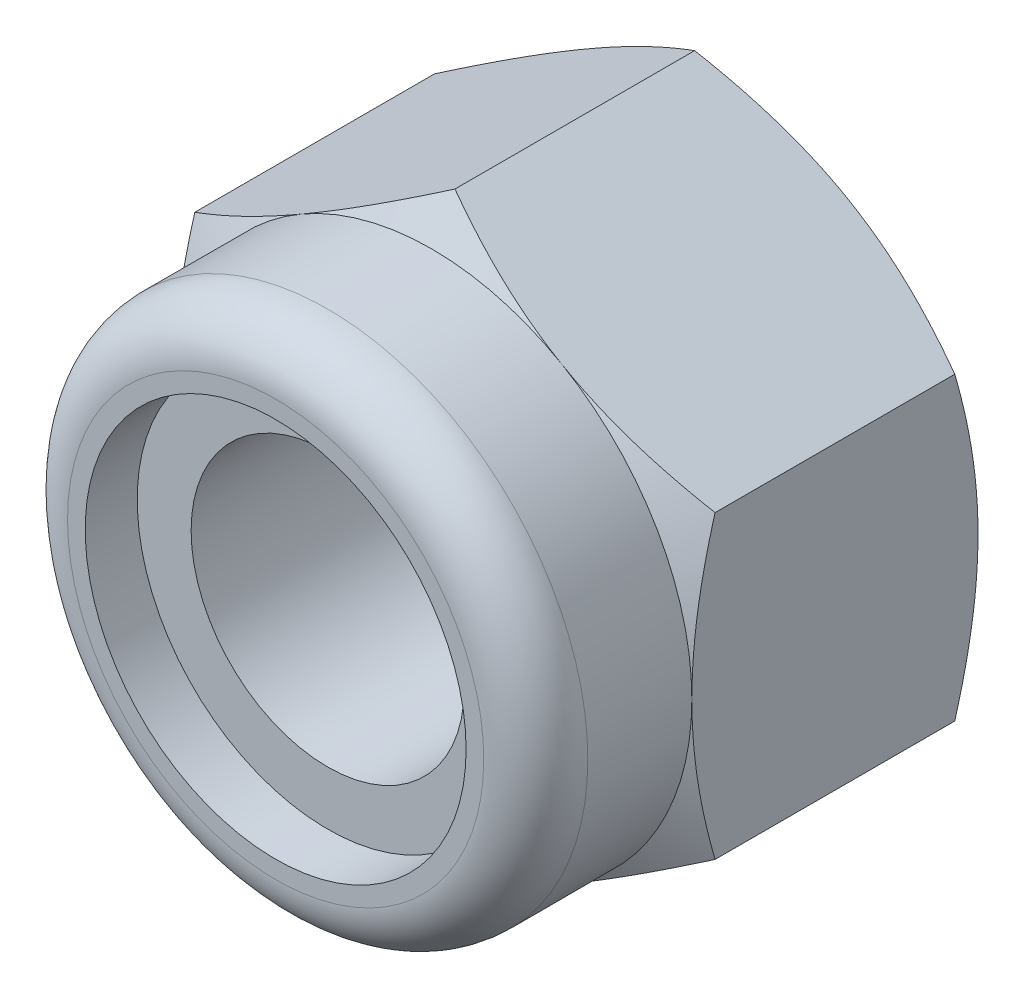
ISO-10303-21;
HEADER;
FILE_DESCRIPTION(('STEP AP214'),'2;1');
FILE_NAME('part.step','',(''),(''),'','','');
FILE_SCHEMA(('AUTOMOTIVE_DESIGN { 1 0 10303 214 1 1 1 1 }'));
ENDSEC;
DATA;
#1=APPLICATION_CONTEXT('core data for automotive mechanical design processes');
#2=APPLICATION_PROTOCOL_DEFINITION('international standard','automotive_design',2000,#1);
#3=PRODUCT_CONTEXT('',#1,'mechanical');
#4=PRODUCT('Part','Part','',(#3));
#5=PRODUCT_RELATED_PRODUCT_CATEGORY('part','',(#4));
#6=PRODUCT_DEFINITION_FORMATION('','',#4);
#7=PRODUCT_DEFINITION_CONTEXT('part definition',#1,'design');
#8=PRODUCT_DEFINITION('design','',#6,#7);
#9=PRODUCT_DEFINITION_SHAPE('','',#8);
#10=(LENGTH_UNIT() NAMED_UNIT(*) SI_UNIT(.MILLI.,.METRE.));
#11=(NAMED_UNIT(*) PLANE_ANGLE_UNIT() SI_UNIT($,.RADIAN.));
#12=(NAMED_UNIT(*) SI_UNIT($,.STERADIAN.) SOLID_ANGLE_UNIT());
#13=UNCERTAINTY_MEASURE_WITH_UNIT(LENGTH_MEASURE(1.E-05),#10,'distance_accuracy_value','');
#14=(GEOMETRIC_REPRESENTATION_CONTEXT(3) GLOBAL_UNCERTAINTY_ASSIGNED_CONTEXT((#13)) GLOBAL_UNIT_ASSIGNED_CONTEXT((#10,
#11,#12)) REPRESENTATION_CONTEXT('',''));
#15=CARTESIAN_POINT('',(0.,0.,0.));
#16=DIRECTION('',(0.,0.,1.));
#17=DIRECTION('',(1.,0.,0.));
#18=AXIS2_PLACEMENT_3D('',#15,#16,#17);
#19=CARTESIAN_POINT('',(0.,0.,-4.4));
#20=DIRECTION('',(0.,0.,1.));
#21=DIRECTION('',(1.,0.,0.));
#22=AXIS2_PLACEMENT_3D('',#19,#20,#21);
#23=CYLINDRICAL_SURFACE('',#22,2.1);
#24=CARTESIAN_POINT('',(0.,0.,1.6));
#25=DIRECTION('',(0.,0.,1.));
#26=DIRECTION('',(1.,0.,0.));
#27=AXIS2_PLACEMENT_3D('',#24,#25,#26);
#28=CIRCLE('',#27,2.1);
#29=CARTESIAN_POINT('',(2.1,0.,1.6));
#30=VERTEX_POINT('',#29);
#31=EDGE_CURVE('E272',#30,#30,#28,.T.);
#32=ORIENTED_EDGE('',*,*,#31,.T.);
#33=EDGE_LOOP('',(#32));
#34=FACE_BOUND('',#33,.T.);
#35=CARTESIAN_POINT('',(0.,0.,-4.09451698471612));
#36=DIRECTION('',(0.,0.,-1.));
#37=DIRECTION('',(-1.,0.,0.));
#38=AXIS2_PLACEMENT_3D('',#35,#36,#37);
#39=CIRCLE('',#38,2.1);
#40=CARTESIAN_POINT('',(-2.1,0.,-4.09451698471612));
#41=VERTEX_POINT('',#40);
#42=EDGE_CURVE('E39',#41,#41,#39,.F.);
#43=ORIENTED_EDGE('',*,*,#42,.F.);
#44=EDGE_LOOP('',(#43));
#45=FACE_BOUND('',#44,.T.);
#46=ADVANCED_FACE('F34',(#34,#45),#23,.F.);
#47=CARTESIAN_POINT('',(0.,4.61880215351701,-4.4));
#48=DIRECTION('',(-0.500000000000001,0.866025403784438,0.));
#49=DIRECTION('',(-0.866025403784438,-0.500000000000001,0.));
#50=AXIS2_PLACEMENT_3D('',#47,#48,#49);
#51=PLANE('',#50);
#52=DIRECTION('',(0.,0.,1.));
#53=VECTOR('',#52,1.);
#54=CARTESIAN_POINT('',(-4.,2.3094010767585,-4.4));
#55=LINE('',#54,#53);
#56=CARTESIAN_POINT('',(-4.,2.30940107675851,-4.04273441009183));
#57=VERTEX_POINT('',#56);
#58=CARTESIAN_POINT('',(-4.,2.3094010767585,-0.357265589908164));
#59=VERTEX_POINT('',#58);
#60=EDGE_CURVE('E245',#57,#59,#55,.T.);
#61=ORIENTED_EDGE('',*,*,#60,.T.);
#62=CARTESIAN_POINT('',(-4.0002,2.30928560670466,-0.357332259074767));
#63=CARTESIAN_POINT('',(-3.82442084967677,2.4107717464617,-0.298717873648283));
#64=CARTESIAN_POINT('',(-3.64712438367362,2.51313390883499,-0.245410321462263));
#65=CARTESIAN_POINT('',(-3.28946140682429,2.71963072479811,-0.152361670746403));
#66=CARTESIAN_POINT('',(-3.10908854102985,2.82376904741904,-0.112653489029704));
#67=CARTESIAN_POINT('',(-2.75057818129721,3.03075510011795,-0.0508422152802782));
#68=CARTESIAN_POINT('',(-2.57249584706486,3.13357098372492,-0.0283277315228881));
#69=CARTESIAN_POINT('',(-2.21549328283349,3.33968651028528,-0.001450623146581));
#70=CARTESIAN_POINT('',(-2.0365743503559,3.44298540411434,0.00293425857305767));
#71=CARTESIAN_POINT('',(-1.70225715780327,3.63600352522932,-0.00619007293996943));
#72=CARTESIAN_POINT('',(-1.54680884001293,3.72575165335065,-0.0174589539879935));
#73=CARTESIAN_POINT('',(-1.23692494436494,3.90466320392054,-0.0531739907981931));
#74=CARTESIAN_POINT('',(-1.08249043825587,3.99382600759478,-0.0776323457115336));
#75=CARTESIAN_POINT('',(-0.771967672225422,4.17310641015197,-0.138776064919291));
#76=CARTESIAN_POINT('',(-0.615918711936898,4.26320131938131,-0.175720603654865));
#77=CARTESIAN_POINT('',(-0.306148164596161,4.44204742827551,-0.259570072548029));
#78=CARTESIAN_POINT('',(-0.152422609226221,4.53080091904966,-0.306455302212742));
#79=CARTESIAN_POINT('',(0.000199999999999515,4.61891762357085,-0.35733225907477));
#80=B_SPLINE_CURVE_WITH_KNOTS('',3,(#62,#63,#64,#65,#66,#67,#68,#69,#70,#71,#72,#73,#74,#75,#76,
#77,#78,#79),.UNSPECIFIED.,.F.,.F.,(4,2,2,2,2,2,2,2,4),(0.,0.634047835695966,1.26961969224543,
1.88946157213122,2.50854226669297,3.04757825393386,3.58711366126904,4.13861653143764,
4.68903648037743),.UNSPECIFIED.);
#81=CARTESIAN_POINT('',(-2.,3.46410161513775,0.));
#82=VERTEX_POINT('',#81);
#83=EDGE_CURVE('E59',#59,#82,#80,.T.);
#84=ORIENTED_EDGE('',*,*,#83,.T.);
#85=CARTESIAN_POINT('',(0.,4.61880215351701,-0.357265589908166));
#86=VERTEX_POINT('',#85);
#87=EDGE_CURVE('E197',#82,#86,#80,.T.);
#88=ORIENTED_EDGE('',*,*,#87,.T.);
#89=DIRECTION('',(0.,0.,1.));
#90=VECTOR('',#89,1.);
#91=CARTESIAN_POINT('',(0.,4.61880215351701,-4.4));
#92=LINE('',#91,#90);
#93=CARTESIAN_POINT('',(0.,4.61880215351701,-4.04273441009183));
#94=VERTEX_POINT('',#93);
#95=EDGE_CURVE('E231',#94,#86,#92,.T.);
#96=ORIENTED_EDGE('',*,*,#95,.F.);
#97=CARTESIAN_POINT('',(-4.0002,2.30928560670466,-4.04266774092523));
#98=CARTESIAN_POINT('',(-3.82442084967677,2.4107717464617,-4.10128212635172));
#99=CARTESIAN_POINT('',(-3.64712438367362,2.51313390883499,-4.15458967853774));
#100=CARTESIAN_POINT('',(-3.28946140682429,2.71963072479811,-4.2476383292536));
#101=CARTESIAN_POINT('',(-3.10908854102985,2.82376904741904,-4.2873465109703));
#102=CARTESIAN_POINT('',(-2.75057818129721,3.03075510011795,-4.34915778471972));
#103=CARTESIAN_POINT('',(-2.57249584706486,3.13357098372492,-4.37167226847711));
#104=CARTESIAN_POINT('',(-2.21549328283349,3.33968651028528,-4.39854937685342));
#105=CARTESIAN_POINT('',(-2.0365743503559,3.44298540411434,-4.40293425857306));
#106=CARTESIAN_POINT('',(-1.70225715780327,3.63600352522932,-4.39380992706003));
#107=CARTESIAN_POINT('',(-1.54680884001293,3.72575165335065,-4.38254104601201));
#108=CARTESIAN_POINT('',(-1.23692494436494,3.90466320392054,-4.34682600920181));
#109=CARTESIAN_POINT('',(-1.08249043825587,3.99382600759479,-4.32236765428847));
#110=CARTESIAN_POINT('',(-0.771967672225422,4.17310641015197,-4.26122393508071));
#111=CARTESIAN_POINT('',(-0.615918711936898,4.26320131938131,-4.22427939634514));
#112=CARTESIAN_POINT('',(-0.306148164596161,4.44204742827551,-4.14042992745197));
#113=CARTESIAN_POINT('',(-0.152422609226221,4.53080091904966,-4.09354469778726));
#114=CARTESIAN_POINT('',(0.00019999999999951,4.61891762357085,-4.04266774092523));
#115=B_SPLINE_CURVE_WITH_KNOTS('',3,(#97,#98,#99,#100,#101,#102,#103,#104,#105,#106,#107,#108,
#109,#110,#111,#112,#113,#114),.UNSPECIFIED.,.F.,.F.,(4,2,2,2,2,2,2,2,4),(0.,0.634047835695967,
1.26961969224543,1.88946157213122,2.50854226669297,3.04757825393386,3.58711366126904,
4.13861653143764,4.68903648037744),.UNSPECIFIED.);
#116=CARTESIAN_POINT('',(-2.,3.46410161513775,-4.4));
#117=VERTEX_POINT('',#116);
#118=EDGE_CURVE('E247',#117,#94,#115,.T.);
#119=ORIENTED_EDGE('',*,*,#118,.F.);
#120=EDGE_CURVE('E226',#57,#117,#115,.T.);
#121=ORIENTED_EDGE('',*,*,#120,.F.);
#122=EDGE_LOOP('',(#61,#84,#88,#96,#119,#121));
#123=FACE_BOUND('',#122,.T.);
#124=ADVANCED_FACE('F36',(#123),#51,.T.);
#125=CARTESIAN_POINT('',(4.,2.3094010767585,-4.4));
#126=DIRECTION('',(0.500000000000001,0.866025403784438,0.));
#127=DIRECTION('',(-0.866025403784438,0.500000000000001,0.));
#128=AXIS2_PLACEMENT_3D('',#125,#126,#127);
#129=PLANE('',#128);
#130=ORIENTED_EDGE('',*,*,#95,.T.);
#131=CARTESIAN_POINT('',(-0.000200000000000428,4.61891762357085,-0.35733225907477));
#132=CARTESIAN_POINT('',(0.175579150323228,4.51743148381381,-0.298717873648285));
#133=CARTESIAN_POINT('',(0.352875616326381,4.41506932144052,-0.245410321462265));
#134=CARTESIAN_POINT('',(0.710538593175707,4.2085725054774,-0.152361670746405));
#135=CARTESIAN_POINT('',(0.890911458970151,4.10443418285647,-0.112653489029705));
#136=CARTESIAN_POINT('',(1.24942181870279,3.89744813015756,-0.0508422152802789));
#137=CARTESIAN_POINT('',(1.42750415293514,3.79463224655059,-0.0283277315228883));
#138=CARTESIAN_POINT('',(1.78450671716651,3.58851671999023,-0.001450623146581));
#139=CARTESIAN_POINT('',(1.9634256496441,3.48521782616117,0.00293425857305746));
#140=CARTESIAN_POINT('',(2.29774284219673,3.29219970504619,-0.00619007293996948));
#141=CARTESIAN_POINT('',(2.45319115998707,3.20245157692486,-0.0174589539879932));
#142=CARTESIAN_POINT('',(2.76307505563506,3.02354002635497,-0.053173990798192));
#143=CARTESIAN_POINT('',(2.91750956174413,2.93437722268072,-0.077632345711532));
#144=CARTESIAN_POINT('',(3.22803232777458,2.75509682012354,-0.138776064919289));
#145=CARTESIAN_POINT('',(3.3840812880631,2.6650019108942,-0.175720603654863));
#146=CARTESIAN_POINT('',(3.69385183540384,2.486155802,-0.259570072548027));
#147=CARTESIAN_POINT('',(3.84757739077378,2.39740231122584,-0.306455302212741));
#148=CARTESIAN_POINT('',(4.0002,2.30928560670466,-0.357332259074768));
#149=B_SPLINE_CURVE_WITH_KNOTS('',3,(#131,#132,#133,#134,#135,#136,#137,#138,#139,#140,#141,
#142,#143,#144,#145,#146,#147,#148),.UNSPECIFIED.,.F.,.F.,(4,2,2,2,2,2,2,2,4),(0.,
0.634047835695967,1.26961969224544,1.88946157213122,2.50854226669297,3.04757825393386,
3.58711366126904,4.13861653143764,4.68903648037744),.UNSPECIFIED.);
#150=CARTESIAN_POINT('',(2.,3.46410161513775,0.));
#151=VERTEX_POINT('',#150);
#152=EDGE_CURVE('E205',#86,#151,#149,.T.);
#153=ORIENTED_EDGE('',*,*,#152,.T.);
#154=CARTESIAN_POINT('',(4.,2.30940107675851,-0.357265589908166));
#155=VERTEX_POINT('',#154);
#156=EDGE_CURVE('E198',#151,#155,#149,.T.);
#157=ORIENTED_EDGE('',*,*,#156,.T.);
#158=DIRECTION('',(0.,0.,1.));
#159=VECTOR('',#158,1.);
#160=CARTESIAN_POINT('',(4.,2.3094010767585,-4.4));
#161=LINE('',#160,#159);
#162=CARTESIAN_POINT('',(4.,2.30940107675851,-4.04273441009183));
#163=VERTEX_POINT('',#162);
#164=EDGE_CURVE('E235',#163,#155,#161,.T.);
#165=ORIENTED_EDGE('',*,*,#164,.F.);
#166=CARTESIAN_POINT('',(-0.000200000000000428,4.61891762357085,-4.04266774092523));
#167=CARTESIAN_POINT('',(0.175579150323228,4.51743148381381,-4.10128212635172));
#168=CARTESIAN_POINT('',(0.352875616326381,4.41506932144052,-4.15458967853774));
#169=CARTESIAN_POINT('',(0.710538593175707,4.2085725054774,-4.2476383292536));
#170=CARTESIAN_POINT('',(0.890911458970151,4.10443418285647,-4.2873465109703));
#171=CARTESIAN_POINT('',(1.24942181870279,3.89744813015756,-4.34915778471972));
#172=CARTESIAN_POINT('',(1.42750415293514,3.79463224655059,-4.37167226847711));
#173=CARTESIAN_POINT('',(1.78450671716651,3.58851671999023,-4.39854937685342));
#174=CARTESIAN_POINT('',(1.9634256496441,3.48521782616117,-4.40293425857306));
#175=CARTESIAN_POINT('',(2.29774284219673,3.29219970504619,-4.39380992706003));
#176=CARTESIAN_POINT('',(2.45319115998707,3.20245157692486,-4.38254104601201));
#177=CARTESIAN_POINT('',(2.76307505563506,3.02354002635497,-4.34682600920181));
#178=CARTESIAN_POINT('',(2.91750956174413,2.93437722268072,-4.32236765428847));
#179=CARTESIAN_POINT('',(3.22803232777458,2.75509682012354,-4.26122393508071));
#180=CARTESIAN_POINT('',(3.3840812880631,2.6650019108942,-4.22427939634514));
#181=CARTESIAN_POINT('',(3.69385183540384,2.486155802,-4.14042992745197));
#182=CARTESIAN_POINT('',(3.84757739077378,2.39740231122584,-4.09354469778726));
#183=CARTESIAN_POINT('',(4.0002,2.30928560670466,-4.04266774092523));
#184=B_SPLINE_CURVE_WITH_KNOTS('',3,(#166,#167,#168,#169,#170,#171,#172,#173,#174,#175,#176,
#177,#178,#179,#180,#181,#182,#183),.UNSPECIFIED.,.F.,.F.,(4,2,2,2,2,2,2,2,4),(0.,
0.634047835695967,1.26961969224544,1.88946157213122,2.50854226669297,3.04757825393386,
3.58711366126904,4.13861653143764,4.68903648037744),.UNSPECIFIED.);
#185=CARTESIAN_POINT('',(2.,3.46410161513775,-4.4));
#186=VERTEX_POINT('',#185);
#187=EDGE_CURVE('E218',#186,#163,#184,.T.);
#188=ORIENTED_EDGE('',*,*,#187,.F.);
#189=EDGE_CURVE('E224',#94,#186,#184,.T.);
#190=ORIENTED_EDGE('',*,*,#189,.F.);
#191=EDGE_LOOP('',(#130,#153,#157,#165,#188,#190));
#192=FACE_BOUND('',#191,.T.);
#193=ADVANCED_FACE('F208',(#192),#129,.T.);
#194=CARTESIAN_POINT('',(4.,2.3094010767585,-4.4));
#195=DIRECTION('',(-1.,0.,0.));
#196=DIRECTION('',(0.,0.,1.));
#197=AXIS2_PLACEMENT_3D('',#194,#195,#196);
#198=PLANE('',#197);
#199=CARTESIAN_POINT('',(4.,-6.12487198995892,-1.91410682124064));
#200=CARTESIAN_POINT('',(4.,-5.94924937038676,-1.8292362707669));
#201=CARTESIAN_POINT('',(4.,-5.77321152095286,-1.7452094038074));
#202=CARTESIAN_POINT('',(4.,-5.42008084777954,-1.57932514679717));
#203=CARTESIAN_POINT('',(4.,-5.24298784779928,-1.49746813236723));
#204=CARTESIAN_POINT('',(4.,-4.88656571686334,-1.33597446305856));
#205=CARTESIAN_POINT('',(4.,-4.70722958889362,-1.25635319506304));
#206=CARTESIAN_POINT('',(4.,-4.34708334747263,-1.1005305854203));
#207=CARTESIAN_POINT('',(4.,-4.16627331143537,-1.02432906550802));
#208=CARTESIAN_POINT('',(4.,-3.80064706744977,-0.875350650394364));
#209=CARTESIAN_POINT('',(4.,-3.6158089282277,-0.802627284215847));
#210=CARTESIAN_POINT('',(4.,-3.24395246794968,-0.66287623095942));
#211=CARTESIAN_POINT('',(4.,-3.05693390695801,-0.595849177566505));
#212=CARTESIAN_POINT('',(4.,-2.6808031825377,-0.469291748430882));
#213=CARTESIAN_POINT('',(4.,-2.49169643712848,-0.409745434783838));
#214=CARTESIAN_POINT('',(4.,-2.11079454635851,-0.300083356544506));
#215=CARTESIAN_POINT('',(4.,-1.91900027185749,-0.249964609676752));
#216=CARTESIAN_POINT('',(4.,-1.532592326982,-0.161590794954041));
#217=CARTESIAN_POINT('',(4.,-1.3379779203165,-0.12333888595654));
#218=CARTESIAN_POINT('',(4.,-0.946402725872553,-0.0612742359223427));
#219=CARTESIAN_POINT('',(4.,-0.749441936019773,-0.0374615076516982));
#220=CARTESIAN_POINT('',(4.,-0.355451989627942,-0.0063818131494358));
#221=CARTESIAN_POINT('',(4.,-0.158431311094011,0.000989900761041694));
#222=CARTESIAN_POINT('',(4.,0.235472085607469,-0.00120406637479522));
#223=CARTESIAN_POINT('',(4.,0.432354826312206,-0.0107653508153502));
#224=CARTESIAN_POINT('',(4.,0.768560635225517,-0.0408787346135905));
#225=CARTESIAN_POINT('',(4.,0.908254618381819,-0.0575092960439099));
#226=CARTESIAN_POINT('',(4.,1.18656349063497,-0.0982134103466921));
#227=CARTESIAN_POINT('',(4.,1.32517820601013,-0.122288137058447));
#228=CARTESIAN_POINT('',(4.,1.73929045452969,-0.204415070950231));
#229=CARTESIAN_POINT('',(4.,2.01284690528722,-0.272348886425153));
#230=CARTESIAN_POINT('',(4.,2.42218253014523,-0.389516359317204));
#231=CARTESIAN_POINT('',(4.,2.56009536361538,-0.431713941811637));
#232=CARTESIAN_POINT('',(4.,2.83448159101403,-0.520284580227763));
#233=CARTESIAN_POINT('',(4.,2.97095590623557,-0.566654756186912));
#234=CARTESIAN_POINT('',(4.,3.2418944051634,-0.662605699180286));
#235=CARTESIAN_POINT('',(4.,3.37636557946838,-0.7121669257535));
#236=CARTESIAN_POINT('',(4.,3.64426461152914,-0.814198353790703));
#237=CARTESIAN_POINT('',(4.,3.77769202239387,-0.86666973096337));
#238=CARTESIAN_POINT('',(4.,3.91063698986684,-0.920309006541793));
#239=B_SPLINE_CURVE_WITH_KNOTS('',3,(#199,#200,#201,#202,#203,#204,#205,#206,#207,#208,#209,
#210,#211,#212,#213,#214,#215,#216,#217,#218,#219,#220,#221,#222,#223,#224,#225,#226,#227,#228,
#229,#230,#231,#232,#233,#234,#235,#236,#237,#238),.UNSPECIFIED.,.F.,.F.,(4,2,2,2,2,2,2,2,2,2,2,
2,2,2,2,2,2,2,2,4),(0.,0.58517179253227,1.17044423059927,1.7590659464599,2.34765694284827,
2.94347400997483,3.53935727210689,4.13394864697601,4.72835161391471,5.32291267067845,
5.91747425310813,6.50823685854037,7.09884609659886,7.52068140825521,7.9425832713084,
8.78701491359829,9.21965281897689,9.65199437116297,10.0819024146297,10.5119854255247),.UNSPECIFIED.);
#240=CARTESIAN_POINT('',(4.,-2.30940107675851,-0.357265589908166));
#241=VERTEX_POINT('',#240);
#242=CARTESIAN_POINT('',(4.,0.,0.));
#243=VERTEX_POINT('',#242);
#244=EDGE_CURVE('E187',#241,#243,#239,.T.);
#245=ORIENTED_EDGE('',*,*,#244,.F.);
#246=DIRECTION('',(0.,0.,1.));
#247=VECTOR('',#246,1.);
#248=CARTESIAN_POINT('',(4.,-2.30940107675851,-4.4));
#249=LINE('',#248,#247);
#250=CARTESIAN_POINT('',(4.,-2.30940107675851,-4.04273441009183));
#251=VERTEX_POINT('',#250);
#252=EDGE_CURVE('E238',#251,#241,#249,.T.);
#253=ORIENTED_EDGE('',*,*,#252,.F.);
#254=CARTESIAN_POINT('',(4.,-6.12487198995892,-2.48589317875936));
#255=CARTESIAN_POINT('',(4.,-5.94924937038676,-2.5707637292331));
#256=CARTESIAN_POINT('',(4.,-5.77321152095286,-2.6547905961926));
#257=CARTESIAN_POINT('',(4.,-5.42008084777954,-2.82067485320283));
#258=CARTESIAN_POINT('',(4.,-5.24298784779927,-2.90253186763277));
#259=CARTESIAN_POINT('',(4.,-4.88656571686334,-3.06402553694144));
#260=CARTESIAN_POINT('',(4.,-4.70722958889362,-3.14364680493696));
#261=CARTESIAN_POINT('',(4.,-4.34708334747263,-3.2994694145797));
#262=CARTESIAN_POINT('',(4.,-4.16627331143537,-3.37567093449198));
#263=CARTESIAN_POINT('',(4.,-3.80064706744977,-3.52464934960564));
#264=CARTESIAN_POINT('',(4.,-3.6158089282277,-3.59737271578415));
#265=CARTESIAN_POINT('',(4.,-3.24395246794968,-3.73712376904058));
#266=CARTESIAN_POINT('',(4.,-3.05693390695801,-3.8041508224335));
#267=CARTESIAN_POINT('',(4.,-2.6808031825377,-3.93070825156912));
#268=CARTESIAN_POINT('',(4.,-2.49169643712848,-3.99025456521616));
#269=CARTESIAN_POINT('',(4.,-2.11079454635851,-4.09991664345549));
#270=CARTESIAN_POINT('',(4.,-1.91900027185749,-4.15003539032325));
#271=CARTESIAN_POINT('',(4.,-1.532592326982,-4.23840920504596));
#272=CARTESIAN_POINT('',(4.,-1.3379779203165,-4.27666111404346));
#273=CARTESIAN_POINT('',(4.,-0.946402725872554,-4.33872576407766));
#274=CARTESIAN_POINT('',(4.,-0.749441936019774,-4.3625384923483));
#275=CARTESIAN_POINT('',(4.,-0.355451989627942,-4.39361818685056));
#276=CARTESIAN_POINT('',(4.,-0.158431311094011,-4.40098990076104));
#277=CARTESIAN_POINT('',(4.,0.235472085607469,-4.39879593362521));
#278=CARTESIAN_POINT('',(4.,0.432354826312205,-4.38923464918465));
#279=CARTESIAN_POINT('',(4.,0.768560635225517,-4.35912126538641));
#280=CARTESIAN_POINT('',(4.,0.908254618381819,-4.34249070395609));
#281=CARTESIAN_POINT('',(4.,1.18656349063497,-4.30178658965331));
#282=CARTESIAN_POINT('',(4.,1.32517820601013,-4.27771186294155));
#283=CARTESIAN_POINT('',(4.,1.73929045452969,-4.19558492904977));
#284=CARTESIAN_POINT('',(4.,2.01284690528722,-4.12765111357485));
#285=CARTESIAN_POINT('',(4.,2.42218253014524,-4.0104836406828));
#286=CARTESIAN_POINT('',(4.,2.56009536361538,-3.96828605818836));
#287=CARTESIAN_POINT('',(4.,2.83448159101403,-3.87971541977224));
#288=CARTESIAN_POINT('',(4.,2.97095590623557,-3.83334524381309));
#289=CARTESIAN_POINT('',(4.,3.2418944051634,-3.73739430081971));
#290=CARTESIAN_POINT('',(4.,3.37636557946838,-3.6878330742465));
#291=CARTESIAN_POINT('',(4.,3.64426461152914,-3.5858016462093));
#292=CARTESIAN_POINT('',(4.,3.77769202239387,-3.53333026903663));
#293=CARTESIAN_POINT('',(4.,3.91063698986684,-3.47969099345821));
#294=B_SPLINE_CURVE_WITH_KNOTS('',3,(#254,#255,#256,#257,#258,#259,#260,#261,#262,#263,#264,
#265,#266,#267,#268,#269,#270,#271,#272,#273,#274,#275,#276,#277,#278,#279,#280,#281,#282,#283,
#284,#285,#286,#287,#288,#289,#290,#291,#292,#293),.UNSPECIFIED.,.F.,.F.,(4,2,2,2,2,2,2,2,2,2,2,
2,2,2,2,2,2,2,2,4),(0.,0.585171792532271,1.17044423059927,1.7590659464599,2.34765694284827,
2.94347400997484,3.53935727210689,4.13394864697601,4.72835161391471,5.32291267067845,
5.91747425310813,6.50823685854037,7.09884609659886,7.52068140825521,7.9425832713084,
8.78701491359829,9.21965281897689,9.65199437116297,10.0819024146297,10.5119854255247),.UNSPECIFIED.);
#295=CARTESIAN_POINT('',(4.,0.,-4.4));
#296=VERTEX_POINT('',#295);
#297=EDGE_CURVE('E360',#251,#296,#294,.T.);
#298=ORIENTED_EDGE('',*,*,#297,.T.);
#299=EDGE_CURVE('E225',#296,#163,#294,.T.);
#300=ORIENTED_EDGE('',*,*,#299,.T.);
#301=ORIENTED_EDGE('',*,*,#164,.T.);
#302=EDGE_CURVE('E196',#243,#155,#239,.T.);
#303=ORIENTED_EDGE('',*,*,#302,.F.);
#304=EDGE_LOOP('',(#245,#253,#298,#300,#301,#303));
#305=FACE_BOUND('',#304,.T.);
#306=ADVANCED_FACE('F212',(#305),#198,.F.);
#307=CARTESIAN_POINT('',(0.,-4.61880215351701,-4.4));
#308=DIRECTION('',(0.500000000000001,-0.866025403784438,0.));
#309=DIRECTION('',(0.866025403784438,0.500000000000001,0.));
#310=AXIS2_PLACEMENT_3D('',#307,#308,#309);
#311=PLANE('',#310);
#312=ORIENTED_EDGE('',*,*,#252,.T.);
#313=CARTESIAN_POINT('',(4.0002,-2.30928560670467,-0.35733225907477));
#314=CARTESIAN_POINT('',(3.82442084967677,-2.41077174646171,-0.298717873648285));
#315=CARTESIAN_POINT('',(3.64712438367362,-2.513133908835,-0.245410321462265));
#316=CARTESIAN_POINT('',(3.28946140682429,-2.71963072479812,-0.152361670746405));
#317=CARTESIAN_POINT('',(3.10908854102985,-2.82376904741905,-0.112653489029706));
#318=CARTESIAN_POINT('',(2.75057818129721,-3.03075510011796,-0.0508422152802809));
#319=CARTESIAN_POINT('',(2.57249584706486,-3.13357098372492,-0.0283277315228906));
#320=CARTESIAN_POINT('',(2.21549328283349,-3.33968651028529,-0.00145062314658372));
#321=CARTESIAN_POINT('',(2.0365743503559,-3.44298540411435,0.00293425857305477));
#322=CARTESIAN_POINT('',(1.70225715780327,-3.63600352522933,-0.00619007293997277));
#323=CARTESIAN_POINT('',(1.54680884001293,-3.72575165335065,-0.0174589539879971));
#324=CARTESIAN_POINT('',(1.23692494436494,-3.90466320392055,-0.0531739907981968));
#325=CARTESIAN_POINT('',(1.08249043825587,-3.99382600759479,-0.0776323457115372));
#326=CARTESIAN_POINT('',(0.771967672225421,-4.17310641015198,-0.138776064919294));
#327=CARTESIAN_POINT('',(0.615918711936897,-4.26320131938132,-0.175720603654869));
#328=CARTESIAN_POINT('',(0.30614816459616,-4.44204742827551,-0.259570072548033));
#329=CARTESIAN_POINT('',(0.152422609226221,-4.53080091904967,-0.306455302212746));
#330=CARTESIAN_POINT('',(-0.000199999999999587,-4.61891762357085,-0.357332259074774));
#331=B_SPLINE_CURVE_WITH_KNOTS('',3,(#313,#314,#315,#316,#317,#318,#319,#320,#321,#322,#323,
#324,#325,#326,#327,#328,#329,#330),.UNSPECIFIED.,.F.,.F.,(4,2,2,2,2,2,2,2,4),(0.,
0.634047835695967,1.26961969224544,1.88946157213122,2.50854226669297,3.04757825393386,
3.58711366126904,4.13861653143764,4.68903648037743),.UNSPECIFIED.);
#332=CARTESIAN_POINT('',(2.,-3.46410161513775,0.));
#333=VERTEX_POINT('',#332);
#334=EDGE_CURVE('E354',#241,#333,#331,.T.);
#335=ORIENTED_EDGE('',*,*,#334,.T.);
#336=CARTESIAN_POINT('',(0.,-4.61880215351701,-0.357265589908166));
#337=VERTEX_POINT('',#336);
#338=EDGE_CURVE('E181',#333,#337,#331,.T.);
#339=ORIENTED_EDGE('',*,*,#338,.T.);
#340=DIRECTION('',(0.,0.,1.));
#341=VECTOR('',#340,1.);
#342=CARTESIAN_POINT('',(0.,-4.61880215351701,-4.4));
#343=LINE('',#342,#341);
#344=CARTESIAN_POINT('',(0.,-4.61880215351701,-4.04273441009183));
#345=VERTEX_POINT('',#344);
#346=EDGE_CURVE('E241',#345,#337,#343,.T.);
#347=ORIENTED_EDGE('',*,*,#346,.F.);
#348=CARTESIAN_POINT('',(4.0002,-2.30928560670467,-4.04266774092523));
#349=CARTESIAN_POINT('',(3.82442084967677,-2.41077174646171,-4.10128212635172));
#350=CARTESIAN_POINT('',(3.64712438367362,-2.513133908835,-4.15458967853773));
#351=CARTESIAN_POINT('',(3.28946140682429,-2.71963072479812,-4.24763832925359));
#352=CARTESIAN_POINT('',(3.10908854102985,-2.82376904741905,-4.28734651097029));
#353=CARTESIAN_POINT('',(2.75057818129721,-3.03075510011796,-4.34915778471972));
#354=CARTESIAN_POINT('',(2.57249584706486,-3.13357098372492,-4.37167226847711));
#355=CARTESIAN_POINT('',(2.21549328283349,-3.33968651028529,-4.39854937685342));
#356=CARTESIAN_POINT('',(2.0365743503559,-3.44298540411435,-4.40293425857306));
#357=CARTESIAN_POINT('',(1.70225715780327,-3.63600352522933,-4.39380992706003));
#358=CARTESIAN_POINT('',(1.54680884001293,-3.72575165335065,-4.382541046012));
#359=CARTESIAN_POINT('',(1.23692494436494,-3.90466320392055,-4.3468260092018));
#360=CARTESIAN_POINT('',(1.08249043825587,-3.99382600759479,-4.32236765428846));
#361=CARTESIAN_POINT('',(0.771967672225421,-4.17310641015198,-4.26122393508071));
#362=CARTESIAN_POINT('',(0.615918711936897,-4.26320131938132,-4.22427939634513));
#363=CARTESIAN_POINT('',(0.30614816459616,-4.44204742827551,-4.14042992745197));
#364=CARTESIAN_POINT('',(0.152422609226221,-4.53080091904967,-4.09354469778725));
#365=CARTESIAN_POINT('',(-0.000199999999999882,-4.61891762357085,-4.04266774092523));
#366=B_SPLINE_CURVE_WITH_KNOTS('',3,(#348,#349,#350,#351,#352,#353,#354,#355,#356,#357,#358,
#359,#360,#361,#362,#363,#364,#365),.UNSPECIFIED.,.F.,.F.,(4,2,2,2,2,2,2,2,4),(0.,
0.634047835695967,1.26961969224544,1.88946157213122,2.50854226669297,3.04757825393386,
3.58711366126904,4.13861653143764,4.68903648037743),.UNSPECIFIED.);
#367=CARTESIAN_POINT('',(2.,-3.46410161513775,-4.4));
#368=VERTEX_POINT('',#367);
#369=EDGE_CURVE('E332',#368,#345,#366,.T.);
#370=ORIENTED_EDGE('',*,*,#369,.F.);
#371=EDGE_CURVE('E356',#251,#368,#366,.T.);
#372=ORIENTED_EDGE('',*,*,#371,.F.);
#373=EDGE_LOOP('',(#312,#335,#339,#347,#370,#372));
#374=FACE_BOUND('',#373,.T.);
#375=ADVANCED_FACE('F339',(#374),#311,.T.);
#376=CARTESIAN_POINT('',(-4.,-2.30940107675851,-4.4));
#377=DIRECTION('',(-0.500000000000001,-0.866025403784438,0.));
#378=DIRECTION('',(0.866025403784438,-0.500000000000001,0.));
#379=AXIS2_PLACEMENT_3D('',#376,#377,#378);
#380=PLANE('',#379);
#381=ORIENTED_EDGE('',*,*,#346,.T.);
#382=CARTESIAN_POINT('',(0.000200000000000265,-4.61891762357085,-0.357332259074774));
#383=CARTESIAN_POINT('',(-0.175579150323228,-4.51743148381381,-0.298717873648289));
#384=CARTESIAN_POINT('',(-0.352875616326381,-4.41506932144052,-0.245410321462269));
#385=CARTESIAN_POINT('',(-0.710538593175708,-4.2085725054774,-0.152361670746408));
#386=CARTESIAN_POINT('',(-0.890911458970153,-4.10443418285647,-0.112653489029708));
#387=CARTESIAN_POINT('',(-1.24942181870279,-3.89744813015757,-0.0508422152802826));
#388=CARTESIAN_POINT('',(-1.42750415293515,-3.7946322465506,-0.0283277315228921));
#389=CARTESIAN_POINT('',(-1.78450671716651,-3.58851671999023,-0.00145062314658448));
#390=CARTESIAN_POINT('',(-1.9634256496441,-3.48521782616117,0.00293425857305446));
#391=CARTESIAN_POINT('',(-2.29774284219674,-3.29219970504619,-0.00619007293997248));
#392=CARTESIAN_POINT('',(-2.45319115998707,-3.20245157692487,-0.0174589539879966));
#393=CARTESIAN_POINT('',(-2.76307505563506,-3.02354002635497,-0.0531739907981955));
#394=CARTESIAN_POINT('',(-2.91750956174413,-2.93437722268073,-0.0776323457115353));
#395=CARTESIAN_POINT('',(-3.22803232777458,-2.75509682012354,-0.138776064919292));
#396=CARTESIAN_POINT('',(-3.3840812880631,-2.6650019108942,-0.175720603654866));
#397=CARTESIAN_POINT('',(-3.69385183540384,-2.48615580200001,-0.25957007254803));
#398=CARTESIAN_POINT('',(-3.84757739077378,-2.39740231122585,-0.306455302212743));
#399=CARTESIAN_POINT('',(-4.0002,-2.30928560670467,-0.35733225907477));
#400=B_SPLINE_CURVE_WITH_KNOTS('',3,(#382,#383,#384,#385,#386,#387,#388,#389,#390,#391,#392,
#393,#394,#395,#396,#397,#398,#399),.UNSPECIFIED.,.F.,.F.,(4,2,2,2,2,2,2,2,4),(0.,
0.634047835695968,1.26961969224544,1.88946157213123,2.50854226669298,3.04757825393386,
3.58711366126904,4.13861653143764,4.68903648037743),.UNSPECIFIED.);
#401=CARTESIAN_POINT('',(-2.,-3.46410161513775,0.));
#402=VERTEX_POINT('',#401);
#403=EDGE_CURVE('E150',#337,#402,#400,.T.);
#404=ORIENTED_EDGE('',*,*,#403,.T.);
#405=CARTESIAN_POINT('',(-4.,-2.30940107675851,-0.357265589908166));
#406=VERTEX_POINT('',#405);
#407=EDGE_CURVE('E141',#402,#406,#400,.T.);
#408=ORIENTED_EDGE('',*,*,#407,.T.);
#409=DIRECTION('',(0.,0.,1.));
#410=VECTOR('',#409,1.);
#411=CARTESIAN_POINT('',(-4.,-2.30940107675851,-4.4));
#412=LINE('',#411,#410);
#413=CARTESIAN_POINT('',(-4.,-2.30940107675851,-4.04273441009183));
#414=VERTEX_POINT('',#413);
#415=EDGE_CURVE('E149',#414,#406,#412,.T.);
#416=ORIENTED_EDGE('',*,*,#415,.F.);
#417=CARTESIAN_POINT('',(0.00020000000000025,-4.61891762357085,-4.04266774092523));
#418=CARTESIAN_POINT('',(-0.175579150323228,-4.51743148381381,-4.10128212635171));
#419=CARTESIAN_POINT('',(-0.352875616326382,-4.41506932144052,-4.15458967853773));
#420=CARTESIAN_POINT('',(-0.710538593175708,-4.2085725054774,-4.24763832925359));
#421=CARTESIAN_POINT('',(-0.890911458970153,-4.10443418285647,-4.28734651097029));
#422=CARTESIAN_POINT('',(-1.24942181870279,-3.89744813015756,-4.34915778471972));
#423=CARTESIAN_POINT('',(-1.42750415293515,-3.7946322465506,-4.37167226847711));
#424=CARTESIAN_POINT('',(-1.78450671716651,-3.58851671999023,-4.39854937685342));
#425=CARTESIAN_POINT('',(-1.96342564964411,-3.48521782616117,-4.40293425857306));
#426=CARTESIAN_POINT('',(-2.29774284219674,-3.29219970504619,-4.39380992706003));
#427=CARTESIAN_POINT('',(-2.45319115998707,-3.20245157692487,-4.382541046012));
#428=CARTESIAN_POINT('',(-2.76307505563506,-3.02354002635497,-4.3468260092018));
#429=CARTESIAN_POINT('',(-2.91750956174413,-2.93437722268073,-4.32236765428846));
#430=CARTESIAN_POINT('',(-3.22803232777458,-2.75509682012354,-4.26122393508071));
#431=CARTESIAN_POINT('',(-3.38408128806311,-2.6650019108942,-4.22427939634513));
#432=CARTESIAN_POINT('',(-3.69385183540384,-2.48615580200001,-4.14042992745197));
#433=CARTESIAN_POINT('',(-3.84757739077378,-2.39740231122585,-4.09354469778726));
#434=CARTESIAN_POINT('',(-4.0002,-2.30928560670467,-4.04266774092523));
#435=B_SPLINE_CURVE_WITH_KNOTS('',3,(#417,#418,#419,#420,#421,#422,#423,#424,#425,#426,#427,
#428,#429,#430,#431,#432,#433,#434),.UNSPECIFIED.,.F.,.F.,(4,2,2,2,2,2,2,2,4),(0.,
0.634047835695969,1.26961969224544,1.88946157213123,2.50854226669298,3.04757825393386,
3.58711366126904,4.13861653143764,4.68903648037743),.UNSPECIFIED.);
#436=CARTESIAN_POINT('',(-2.,-3.46410161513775,-4.4));
#437=VERTEX_POINT('',#436);
#438=EDGE_CURVE('E321',#437,#414,#435,.T.);
#439=ORIENTED_EDGE('',*,*,#438,.F.);
#440=EDGE_CURVE('E331',#345,#437,#435,.T.);
#441=ORIENTED_EDGE('',*,*,#440,.F.);
#442=EDGE_LOOP('',(#381,#404,#408,#416,#439,#441));
#443=FACE_BOUND('',#442,.T.);
#444=ADVANCED_FACE('F336',(#443),#380,.T.);
#445=CARTESIAN_POINT('',(-4.,2.3094010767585,-4.4));
#446=DIRECTION('',(-1.,0.,0.));
#447=DIRECTION('',(0.,0.,1.));
#448=AXIS2_PLACEMENT_3D('',#445,#446,#447);
#449=PLANE('',#448);
#450=ORIENTED_EDGE('',*,*,#415,.T.);
#451=CARTESIAN_POINT('',(-4.,-6.12487198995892,-1.91410682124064));
#452=CARTESIAN_POINT('',(-4.,-5.94924937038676,-1.8292362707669));
#453=CARTESIAN_POINT('',(-4.,-5.77321152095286,-1.7452094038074));
#454=CARTESIAN_POINT('',(-4.,-5.42008084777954,-1.57932514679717));
#455=CARTESIAN_POINT('',(-4.,-5.24298784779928,-1.49746813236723));
#456=CARTESIAN_POINT('',(-4.,-4.88656571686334,-1.33597446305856));
#457=CARTESIAN_POINT('',(-4.,-4.70722958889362,-1.25635319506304));
#458=CARTESIAN_POINT('',(-4.,-4.34708334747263,-1.1005305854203));
#459=CARTESIAN_POINT('',(-4.,-4.16627331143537,-1.02432906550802));
#460=CARTESIAN_POINT('',(-4.,-3.80064706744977,-0.875350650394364));
#461=CARTESIAN_POINT('',(-4.,-3.6158089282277,-0.802627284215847));
#462=CARTESIAN_POINT('',(-4.,-3.24395246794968,-0.662876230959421));
#463=CARTESIAN_POINT('',(-4.,-3.05693390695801,-0.595849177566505));
#464=CARTESIAN_POINT('',(-4.,-2.68080318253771,-0.469291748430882));
#465=CARTESIAN_POINT('',(-4.,-2.49169643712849,-0.409745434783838));
#466=CARTESIAN_POINT('',(-4.,-2.11079454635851,-0.300083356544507));
#467=CARTESIAN_POINT('',(-4.,-1.91900027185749,-0.249964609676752));
#468=CARTESIAN_POINT('',(-4.,-1.532592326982,-0.161590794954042));
#469=CARTESIAN_POINT('',(-4.,-1.3379779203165,-0.12333888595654));
#470=CARTESIAN_POINT('',(-4.,-0.946402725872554,-0.0612742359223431));
#471=CARTESIAN_POINT('',(-4.,-0.749441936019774,-0.0374615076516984));
#472=CARTESIAN_POINT('',(-4.,-0.355451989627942,-0.00638181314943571));
#473=CARTESIAN_POINT('',(-4.,-0.158431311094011,0.000989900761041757));
#474=CARTESIAN_POINT('',(-4.,0.235472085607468,-0.00120406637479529));
#475=CARTESIAN_POINT('',(-4.,0.432354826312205,-0.0107653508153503));
#476=CARTESIAN_POINT('',(-4.,0.768560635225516,-0.0408787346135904));
#477=CARTESIAN_POINT('',(-4.,0.908254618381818,-0.0575092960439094));
#478=CARTESIAN_POINT('',(-4.,1.18656349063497,-0.0982134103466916));
#479=CARTESIAN_POINT('',(-4.,1.32517820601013,-0.122288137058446));
#480=CARTESIAN_POINT('',(-4.,1.73929045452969,-0.204415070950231));
#481=CARTESIAN_POINT('',(-4.,2.01284690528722,-0.272348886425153));
#482=CARTESIAN_POINT('',(-4.,2.42218253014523,-0.389516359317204));
#483=CARTESIAN_POINT('',(-4.,2.56009536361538,-0.431713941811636));
#484=CARTESIAN_POINT('',(-4.,2.83448159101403,-0.520284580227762));
#485=CARTESIAN_POINT('',(-4.,2.97095590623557,-0.566654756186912));
#486=CARTESIAN_POINT('',(-4.,3.2418944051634,-0.662605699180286));
#487=CARTESIAN_POINT('',(-4.,3.37636557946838,-0.7121669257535));
#488=CARTESIAN_POINT('',(-4.,3.64426461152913,-0.814198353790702));
#489=CARTESIAN_POINT('',(-4.,3.77769202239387,-0.866669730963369));
#490=CARTESIAN_POINT('',(-4.,3.91063698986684,-0.920309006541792));
#491=B_SPLINE_CURVE_WITH_KNOTS('',3,(#451,#452,#453,#454,#455,#456,#457,#458,#459,#460,#461,
#462,#463,#464,#465,#466,#467,#468,#469,#470,#471,#472,#473,#474,#475,#476,#477,#478,#479,#480,
#481,#482,#483,#484,#485,#486,#487,#488,#489,#490),.UNSPECIFIED.,.F.,.F.,(4,2,2,2,2,2,2,2,2,2,2,
2,2,2,2,2,2,2,2,4),(0.,0.585171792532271,1.17044423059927,1.7590659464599,2.34765694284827,
2.94347400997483,3.53935727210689,4.133948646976,4.72835161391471,5.32291267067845,
5.91747425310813,6.50823685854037,7.09884609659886,7.52068140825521,7.94258327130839,
8.78701491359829,9.21965281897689,9.65199437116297,10.0819024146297,10.5119854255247),.UNSPECIFIED.);
#492=CARTESIAN_POINT('',(-4.,0.,0.));
#493=VERTEX_POINT('',#492);
#494=EDGE_CURVE('E134',#406,#493,#491,.T.);
#495=ORIENTED_EDGE('',*,*,#494,.T.);
#496=EDGE_CURVE('E128',#493,#59,#491,.T.);
#497=ORIENTED_EDGE('',*,*,#496,.T.);
#498=ORIENTED_EDGE('',*,*,#60,.F.);
#499=CARTESIAN_POINT('',(-4.,-6.12487198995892,-2.48589317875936));
#500=CARTESIAN_POINT('',(-4.,-5.94924937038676,-2.5707637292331));
#501=CARTESIAN_POINT('',(-4.,-5.77321152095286,-2.6547905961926));
#502=CARTESIAN_POINT('',(-4.,-5.42008084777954,-2.82067485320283));
#503=CARTESIAN_POINT('',(-4.,-5.24298784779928,-2.90253186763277));
#504=CARTESIAN_POINT('',(-4.,-4.88656571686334,-3.06402553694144));
#505=CARTESIAN_POINT('',(-4.,-4.70722958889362,-3.14364680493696));
#506=CARTESIAN_POINT('',(-4.,-4.34708334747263,-3.2994694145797));
#507=CARTESIAN_POINT('',(-4.,-4.16627331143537,-3.37567093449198));
#508=CARTESIAN_POINT('',(-4.,-3.80064706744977,-3.52464934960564));
#509=CARTESIAN_POINT('',(-4.,-3.6158089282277,-3.59737271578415));
#510=CARTESIAN_POINT('',(-4.,-3.24395246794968,-3.73712376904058));
#511=CARTESIAN_POINT('',(-4.,-3.05693390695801,-3.8041508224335));
#512=CARTESIAN_POINT('',(-4.,-2.68080318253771,-3.93070825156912));
#513=CARTESIAN_POINT('',(-4.,-2.49169643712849,-3.99025456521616));
#514=CARTESIAN_POINT('',(-4.,-2.11079454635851,-4.09991664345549));
#515=CARTESIAN_POINT('',(-4.,-1.91900027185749,-4.15003539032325));
#516=CARTESIAN_POINT('',(-4.,-1.532592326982,-4.23840920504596));
#517=CARTESIAN_POINT('',(-4.,-1.3379779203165,-4.27666111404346));
#518=CARTESIAN_POINT('',(-4.,-0.946402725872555,-4.33872576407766));
#519=CARTESIAN_POINT('',(-4.,-0.749441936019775,-4.3625384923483));
#520=CARTESIAN_POINT('',(-4.,-0.355451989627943,-4.39361818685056));
#521=CARTESIAN_POINT('',(-4.,-0.158431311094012,-4.40098990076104));
#522=CARTESIAN_POINT('',(-4.,0.235472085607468,-4.39879593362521));
#523=CARTESIAN_POINT('',(-4.,0.432354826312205,-4.38923464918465));
#524=CARTESIAN_POINT('',(-4.,0.768560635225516,-4.35912126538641));
#525=CARTESIAN_POINT('',(-4.,0.908254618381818,-4.34249070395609));
#526=CARTESIAN_POINT('',(-4.,1.18656349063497,-4.30178658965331));
#527=CARTESIAN_POINT('',(-4.,1.32517820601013,-4.27771186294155));
#528=CARTESIAN_POINT('',(-4.,1.73929045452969,-4.19558492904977));
#529=CARTESIAN_POINT('',(-4.,2.01284690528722,-4.12765111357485));
#530=CARTESIAN_POINT('',(-4.,2.42218253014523,-4.0104836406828));
#531=CARTESIAN_POINT('',(-4.,2.56009536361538,-3.96828605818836));
#532=CARTESIAN_POINT('',(-4.,2.83448159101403,-3.87971541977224));
#533=CARTESIAN_POINT('',(-4.,2.97095590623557,-3.83334524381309));
#534=CARTESIAN_POINT('',(-4.,3.2418944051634,-3.73739430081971));
#535=CARTESIAN_POINT('',(-4.,3.37636557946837,-3.6878330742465));
#536=CARTESIAN_POINT('',(-4.,3.64426461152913,-3.5858016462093));
#537=CARTESIAN_POINT('',(-4.,3.77769202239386,-3.53333026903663));
#538=CARTESIAN_POINT('',(-4.,3.91063698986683,-3.47969099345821));
#539=B_SPLINE_CURVE_WITH_KNOTS('',3,(#499,#500,#501,#502,#503,#504,#505,#506,#507,#508,#509,
#510,#511,#512,#513,#514,#515,#516,#517,#518,#519,#520,#521,#522,#523,#524,#525,#526,#527,#528,
#529,#530,#531,#532,#533,#534,#535,#536,#537,#538),.UNSPECIFIED.,.F.,.F.,(4,2,2,2,2,2,2,2,2,2,2,
2,2,2,2,2,2,2,2,4),(0.,0.585171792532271,1.17044423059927,1.7590659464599,2.34765694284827,
2.94347400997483,3.53935727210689,4.133948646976,4.72835161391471,5.32291267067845,
5.91747425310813,6.50823685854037,7.09884609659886,7.52068140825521,7.94258327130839,
8.78701491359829,9.21965281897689,9.65199437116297,10.0819024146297,10.5119854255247),.UNSPECIFIED.);
#540=CARTESIAN_POINT('',(-4.,0.,-4.4));
#541=VERTEX_POINT('',#540);
#542=EDGE_CURVE('E317',#541,#57,#539,.T.);
#543=ORIENTED_EDGE('',*,*,#542,.F.);
#544=EDGE_CURVE('E319',#414,#541,#539,.T.);
#545=ORIENTED_EDGE('',*,*,#544,.F.);
#546=EDGE_LOOP('',(#450,#495,#497,#498,#543,#545));
#547=FACE_BOUND('',#546,.T.);
#548=ADVANCED_FACE('F146',(#547),#449,.T.);
#549=CARTESIAN_POINT('',(0.,4.61880215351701,-4.4));
#550=DIRECTION('',(0.,0.,-1.));
#551=DIRECTION('',(-1.,0.,0.));
#552=AXIS2_PLACEMENT_3D('',#549,#550,#551);
#553=PLANE('',#552);
#554=CARTESIAN_POINT('',(0.,0.,-4.4));
#555=DIRECTION('',(0.,0.,-1.));
#556=DIRECTION('',(-1.,0.,0.));
#557=AXIS2_PLACEMENT_3D('',#554,#555,#556);
#558=CIRCLE('',#557,2.5);
#559=CARTESIAN_POINT('',(-2.5,0.,-4.4));
#560=VERTEX_POINT('',#559);
#561=EDGE_CURVE('E250',#560,#560,#558,.F.);
#562=ORIENTED_EDGE('',*,*,#561,.T.);
#563=EDGE_LOOP('',(#562));
#564=FACE_BOUND('',#563,.T.);
#565=CARTESIAN_POINT('',(0.,0.,-4.4));
#566=DIRECTION('',(0.,0.,-1.));
#567=DIRECTION('',(-1.,0.,0.));
#568=AXIS2_PLACEMENT_3D('',#565,#566,#567);
#569=CIRCLE('',#568,4.);
#570=EDGE_CURVE('E144',#541,#437,#569,.F.);
#571=ORIENTED_EDGE('',*,*,#570,.F.);
#572=EDGE_CURVE('E234',#117,#541,#569,.F.);
#573=ORIENTED_EDGE('',*,*,#572,.F.);
#574=EDGE_CURVE('E249',#186,#117,#569,.F.);
#575=ORIENTED_EDGE('',*,*,#574,.F.);
#576=CARTESIAN_POINT('',(0.,0.,-4.4));
#577=DIRECTION('',(0.,0.,1.));
#578=DIRECTION('',(1.,0.,0.));
#579=AXIS2_PLACEMENT_3D('',#576,#577,#578);
#580=CIRCLE('',#579,4.);
#581=EDGE_CURVE('E206',#296,#186,#580,.T.);
#582=ORIENTED_EDGE('',*,*,#581,.F.);
#583=EDGE_CURVE('E392',#368,#296,#569,.F.);
#584=ORIENTED_EDGE('',*,*,#583,.F.);
#585=EDGE_CURVE('E384',#437,#368,#569,.F.);
#586=ORIENTED_EDGE('',*,*,#585,.F.);
#587=EDGE_LOOP('',(#571,#573,#575,#582,#584,#586));
#588=FACE_BOUND('',#587,.T.);
#589=ADVANCED_FACE('F214',(#564,#588),#553,.T.);
#590=CARTESIAN_POINT('',(0.,0.,-4.4));
#591=DIRECTION('',(0.,0.,1.));
#592=DIRECTION('',(1.,0.,0.));
#593=AXIS2_PLACEMENT_3D('',#590,#591,#592);
#594=CONICAL_SURFACE('',#593,4.,1.0471975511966);
#595=ORIENTED_EDGE('',*,*,#120,.T.);
#596=ORIENTED_EDGE('',*,*,#572,.T.);
#597=ORIENTED_EDGE('',*,*,#542,.T.);
#598=EDGE_LOOP('',(#595,#596,#597));
#599=FACE_BOUND('',#598,.T.);
#600=ADVANCED_FACE('F403',(#599),#594,.T.);
#601=ORIENTED_EDGE('',*,*,#118,.T.);
#602=ORIENTED_EDGE('',*,*,#189,.T.);
#603=ORIENTED_EDGE('',*,*,#574,.T.);
#604=EDGE_LOOP('',(#601,#602,#603));
#605=FACE_BOUND('',#604,.T.);
#606=ADVANCED_FACE('F401',(#605),#594,.T.);
#607=ORIENTED_EDGE('',*,*,#187,.T.);
#608=ORIENTED_EDGE('',*,*,#299,.F.);
#609=ORIENTED_EDGE('',*,*,#581,.T.);
#610=EDGE_LOOP('',(#607,#608,#609));
#611=FACE_BOUND('',#610,.T.);
#612=ADVANCED_FACE('F410',(#611),#594,.T.);
#613=ORIENTED_EDGE('',*,*,#371,.T.);
#614=ORIENTED_EDGE('',*,*,#583,.T.);
#615=ORIENTED_EDGE('',*,*,#297,.F.);
#616=EDGE_LOOP('',(#613,#614,#615));
#617=FACE_BOUND('',#616,.T.);
#618=ADVANCED_FACE('F405',(#617),#594,.T.);
#619=ORIENTED_EDGE('',*,*,#369,.T.);
#620=ORIENTED_EDGE('',*,*,#440,.T.);
#621=ORIENTED_EDGE('',*,*,#585,.T.);
#622=EDGE_LOOP('',(#619,#620,#621));
#623=FACE_BOUND('',#622,.T.);
#624=ADVANCED_FACE('F382',(#623),#594,.T.);
#625=ORIENTED_EDGE('',*,*,#438,.T.);
#626=ORIENTED_EDGE('',*,*,#544,.T.);
#627=ORIENTED_EDGE('',*,*,#570,.T.);
#628=EDGE_LOOP('',(#625,#626,#627));
#629=FACE_BOUND('',#628,.T.);
#630=ADVANCED_FACE('F169',(#629),#594,.T.);
#631=CARTESIAN_POINT('',(0.,0.,0.));
#632=DIRECTION('',(0.,0.,-1.));
#633=DIRECTION('',(-1.,0.,0.));
#634=AXIS2_PLACEMENT_3D('',#631,#632,#633);
#635=CONICAL_SURFACE('',#634,4.,1.0471975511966);
#636=CARTESIAN_POINT('',(0.,0.,0.));
#637=DIRECTION('',(0.,0.,-1.));
#638=DIRECTION('',(-1.,0.,0.));
#639=AXIS2_PLACEMENT_3D('',#636,#637,#638);
#640=CIRCLE('',#639,4.);
#641=EDGE_CURVE('E46',#402,#493,#640,.T.);
#642=ORIENTED_EDGE('',*,*,#641,.T.);
#643=ORIENTED_EDGE('',*,*,#494,.F.);
#644=ORIENTED_EDGE('',*,*,#407,.F.);
#645=EDGE_LOOP('',(#642,#643,#644));
#646=FACE_BOUND('',#645,.T.);
#647=ADVANCED_FACE('F139',(#646),#635,.T.);
#648=EDGE_CURVE('E143',#333,#402,#640,.T.);
#649=ORIENTED_EDGE('',*,*,#648,.T.);
#650=ORIENTED_EDGE('',*,*,#403,.F.);
#651=ORIENTED_EDGE('',*,*,#338,.F.);
#652=EDGE_LOOP('',(#649,#650,#651));
#653=FACE_BOUND('',#652,.T.);
#654=ADVANCED_FACE('F168',(#653),#635,.T.);
#655=ORIENTED_EDGE('',*,*,#244,.T.);
#656=EDGE_CURVE('E395',#243,#333,#640,.T.);
#657=ORIENTED_EDGE('',*,*,#656,.T.);
#658=ORIENTED_EDGE('',*,*,#334,.F.);
#659=EDGE_LOOP('',(#655,#657,#658));
#660=FACE_BOUND('',#659,.T.);
#661=ADVANCED_FACE('F396',(#660),#635,.T.);
#662=CARTESIAN_POINT('',(0.,0.,0.));
#663=DIRECTION('',(0.,0.,1.));
#664=DIRECTION('',(1.,0.,0.));
#665=AXIS2_PLACEMENT_3D('',#662,#663,#664);
#666=CIRCLE('',#665,4.);
#667=EDGE_CURVE('E135',#243,#151,#666,.T.);
#668=ORIENTED_EDGE('',*,*,#667,.F.);
#669=ORIENTED_EDGE('',*,*,#302,.T.);
#670=ORIENTED_EDGE('',*,*,#156,.F.);
#671=EDGE_LOOP('',(#668,#669,#670));
#672=FACE_BOUND('',#671,.T.);
#673=ADVANCED_FACE('F368',(#672),#635,.T.);
#674=EDGE_CURVE('E44',#82,#151,#640,.T.);
#675=ORIENTED_EDGE('',*,*,#674,.T.);
#676=ORIENTED_EDGE('',*,*,#152,.F.);
#677=ORIENTED_EDGE('',*,*,#87,.F.);
#678=EDGE_LOOP('',(#675,#676,#677));
#679=FACE_BOUND('',#678,.T.);
#680=ADVANCED_FACE('F170',(#679),#635,.T.);
#681=ORIENTED_EDGE('',*,*,#496,.F.);
#682=EDGE_CURVE('E11',#493,#82,#640,.T.);
#683=ORIENTED_EDGE('',*,*,#682,.T.);
#684=ORIENTED_EDGE('',*,*,#83,.F.);
#685=EDGE_LOOP('',(#681,#683,#684));
#686=FACE_BOUND('',#685,.T.);
#687=ADVANCED_FACE('F129',(#686),#635,.T.);
#688=CARTESIAN_POINT('',(0.,0.,-4.3746));
#689=DIRECTION('',(0.,0.,-1.));
#690=DIRECTION('',(-1.,0.,0.));
#691=AXIS2_PLACEMENT_3D('',#688,#689,#690);
#692=CONICAL_SURFACE('',#691,2.5,0.959931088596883);
#693=CARTESIAN_POINT('',(0.,0.,-4.3746));
#694=DIRECTION('',(0.,0.,1.));
#695=DIRECTION('',(1.,0.,0.));
#696=AXIS2_PLACEMENT_3D('',#693,#694,#695);
#697=CIRCLE('',#696,2.5);
#698=CARTESIAN_POINT('',(2.5,0.,-4.3746));
#699=VERTEX_POINT('',#698);
#700=EDGE_CURVE('E252',#699,#699,#697,.T.);
#701=ORIENTED_EDGE('',*,*,#700,.F.);
#702=EDGE_LOOP('',(#701));
#703=FACE_BOUND('',#702,.T.);
#704=ORIENTED_EDGE('',*,*,#42,.T.);
#705=EDGE_LOOP('',(#704));
#706=FACE_BOUND('',#705,.T.);
#707=ADVANCED_FACE('F472',(#703,#706),#692,.F.);
#708=CARTESIAN_POINT('',(0.,0.,-25.0375057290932));
#709=DIRECTION('',(0.,0.,1.));
#710=DIRECTION('',(1.,0.,0.));
#711=AXIS2_PLACEMENT_3D('',#708,#709,#710);
#712=CYLINDRICAL_SURFACE('',#711,2.5);
#713=ORIENTED_EDGE('',*,*,#561,.F.);
#714=EDGE_LOOP('',(#713));
#715=FACE_BOUND('',#714,.T.);
#716=ORIENTED_EDGE('',*,*,#700,.T.);
#717=EDGE_LOOP('',(#716));
#718=FACE_BOUND('',#717,.T.);
#719=ADVANCED_FACE('F171',(#715,#718),#712,.F.);
#720=CARTESIAN_POINT('',(0.,2.1,1.6));
#721=DIRECTION('',(0.,0.,-1.));
#722=DIRECTION('',(-1.,0.,0.));
#723=AXIS2_PLACEMENT_3D('',#720,#721,#722);
#724=PLANE('',#723);
#725=ORIENTED_EDGE('',*,*,#31,.F.);
#726=EDGE_LOOP('',(#725));
#727=FACE_BOUND('',#726,.T.);
#728=CARTESIAN_POINT('',(0.,0.,1.6));
#729=DIRECTION('',(0.,0.,1.));
#730=DIRECTION('',(1.,0.,0.));
#731=AXIS2_PLACEMENT_3D('',#728,#729,#730);
#732=CIRCLE('',#731,2.92857142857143);
#733=CARTESIAN_POINT('',(2.92857142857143,0.,1.6));
#734=VERTEX_POINT('',#733);
#735=EDGE_CURVE('E257',#734,#734,#732,.T.);
#736=ORIENTED_EDGE('',*,*,#735,.T.);
#737=EDGE_LOOP('',(#736));
#738=FACE_BOUND('',#737,.T.);
#739=ADVANCED_FACE('F278',(#727,#738),#724,.F.);
#740=CARTESIAN_POINT('',(0.,0.,9.48088822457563));
#741=DIRECTION('',(0.,0.,1.));
#742=DIRECTION('',(1.,0.,0.));
#743=AXIS2_PLACEMENT_3D('',#740,#741,#742);
#744=CYLINDRICAL_SURFACE('',#743,2.92857142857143);
#745=ORIENTED_EDGE('',*,*,#735,.F.);
#746=EDGE_LOOP('',(#745));
#747=FACE_BOUND('',#746,.T.);
#748=CARTESIAN_POINT('',(0.,0.,2.4));
#749=DIRECTION('',(0.,0.,1.));
#750=DIRECTION('',(1.,0.,0.));
#751=AXIS2_PLACEMENT_3D('',#748,#749,#750);
#752=CIRCLE('',#751,2.92857142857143);
#753=CARTESIAN_POINT('',(2.92857142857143,0.,2.4));
#754=VERTEX_POINT('',#753);
#755=EDGE_CURVE('E261',#754,#754,#752,.T.);
#756=ORIENTED_EDGE('',*,*,#755,.T.);
#757=EDGE_LOOP('',(#756));
#758=FACE_BOUND('',#757,.T.);
#759=ADVANCED_FACE('F281',(#747,#758),#744,.F.);
#760=CARTESIAN_POINT('',(0.,2.92857142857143,2.4));
#761=DIRECTION('',(0.,0.,-1.));
#762=DIRECTION('',(-1.,0.,0.));
#763=AXIS2_PLACEMENT_3D('',#760,#761,#762);
#764=PLANE('',#763);
#765=ORIENTED_EDGE('',*,*,#755,.F.);
#766=EDGE_LOOP('',(#765));
#767=FACE_BOUND('',#766,.T.);
#768=CARTESIAN_POINT('',(0.,0.,2.4));
#769=DIRECTION('',(0.,0.,1.));
#770=DIRECTION('',(1.,0.,0.));
#771=AXIS2_PLACEMENT_3D('',#768,#769,#770);
#772=CIRCLE('',#771,3.2);
#773=CARTESIAN_POINT('',(3.2,0.,2.4));
#774=VERTEX_POINT('',#773);
#775=EDGE_CURVE('E266',#774,#774,#772,.T.);
#776=ORIENTED_EDGE('',*,*,#775,.T.);
#777=EDGE_LOOP('',(#776));
#778=FACE_BOUND('',#777,.T.);
#779=ADVANCED_FACE('F287',(#767,#778),#764,.F.);
#780=CARTESIAN_POINT('',(0.,0.,1.6));
#781=DIRECTION('',(0.,0.,1.));
#782=DIRECTION('',(1.,0.,0.));
#783=AXIS2_PLACEMENT_3D('',#780,#781,#782);
#784=TOROIDAL_SURFACE('',#783,3.2,0.8);
#785=ORIENTED_EDGE('',*,*,#775,.F.);
#786=EDGE_LOOP('',(#785));
#787=FACE_BOUND('',#786,.T.);
#788=CARTESIAN_POINT('',(0.,0.,1.6));
#789=DIRECTION('',(0.,0.,1.));
#790=DIRECTION('',(1.,0.,0.));
#791=AXIS2_PLACEMENT_3D('',#788,#789,#790);
#792=CIRCLE('',#791,4.);
#793=CARTESIAN_POINT('',(4.,0.,1.6));
#794=VERTEX_POINT('',#793);
#795=EDGE_CURVE('E269',#794,#794,#792,.T.);
#796=ORIENTED_EDGE('',*,*,#795,.T.);
#797=EDGE_LOOP('',(#796));
#798=FACE_BOUND('',#797,.T.);
#799=ADVANCED_FACE('F293',(#787,#798),#784,.T.);
#800=CARTESIAN_POINT('',(0.,0.,9.48088822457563));
#801=DIRECTION('',(0.,0.,1.));
#802=DIRECTION('',(1.,0.,0.));
#803=AXIS2_PLACEMENT_3D('',#800,#801,#802);
#804=CYLINDRICAL_SURFACE('',#803,4.);
#805=ORIENTED_EDGE('',*,*,#641,.F.);
#806=ORIENTED_EDGE('',*,*,#648,.F.);
#807=ORIENTED_EDGE('',*,*,#656,.F.);
#808=ORIENTED_EDGE('',*,*,#667,.T.);
#809=ORIENTED_EDGE('',*,*,#674,.F.);
#810=ORIENTED_EDGE('',*,*,#682,.F.);
#811=EDGE_LOOP('',(#805,#806,#807,#808,#809,#810));
#812=FACE_BOUND('',#811,.T.);
#813=ORIENTED_EDGE('',*,*,#795,.F.);
#814=EDGE_LOOP('',(#813));
#815=FACE_BOUND('',#814,.T.);
#816=ADVANCED_FACE('F124',(#812,#815),#804,.T.);
#817=CLOSED_SHELL('',(#46,#124,#193,#306,#375,#444,#548,#589,#600,#606,#612,#618,#624,#630,#647,
#654,#661,#673,#680,#687,#707,#719,#739,#759,#779,#799,#816));
#818=MANIFOLD_SOLID_BREP('B2',#817);
#819=ADVANCED_BREP_SHAPE_REPRESENTATION('',(#18,#818),#14);
#820=SHAPE_DEFINITION_REPRESENTATION(#9,#819);
ENDSEC;
END-ISO-10303-21;
